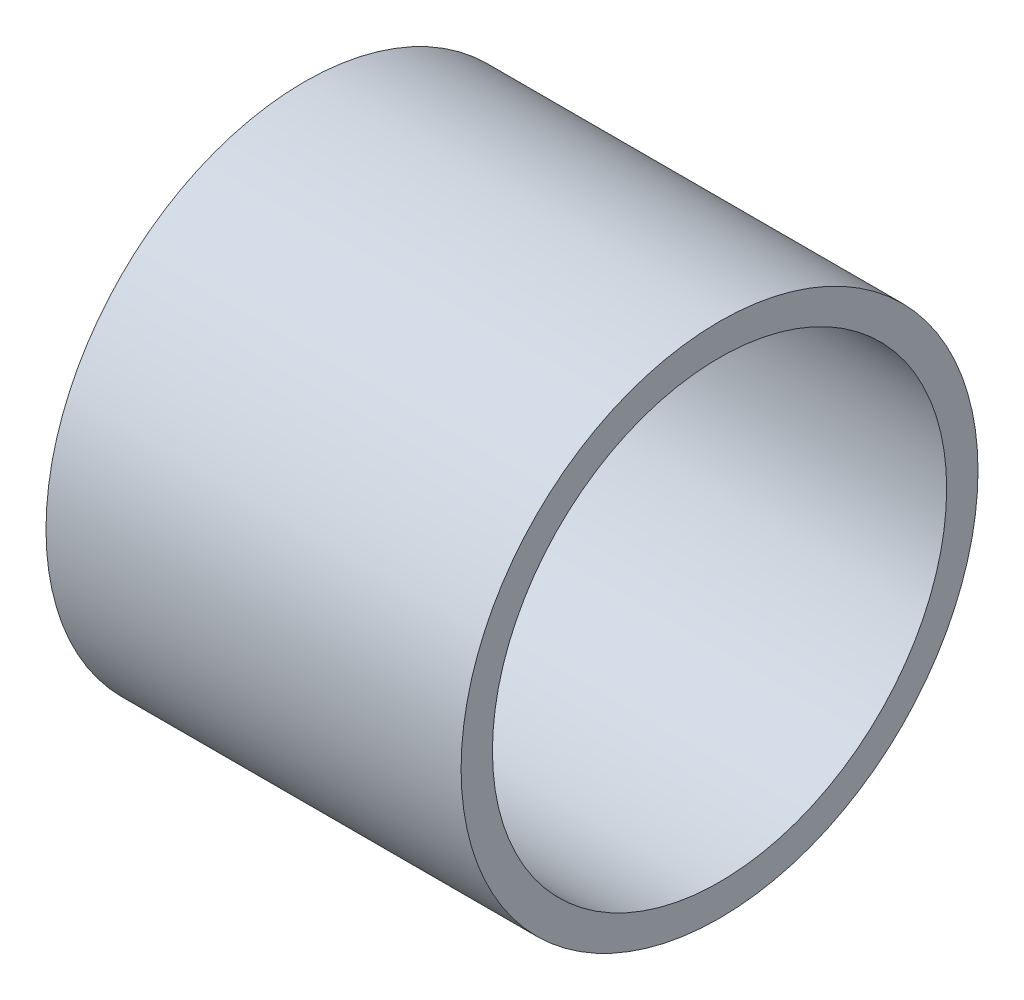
from build123d import *

# Parameters (mm, degrees)
ESQUISSE1_W = 53
ESQUISSE1_H = 4


with BuildPart() as part:
    # Esquisse1 → R_volution1 (revolve)
    with BuildSketch(Plane.XY, mode=Mode.PRIVATE) as r_volution1_sk:
        with Locations((26.5, 31)):
            Rectangle(ESQUISSE1_W, ESQUISSE1_H)
    revolve(r_volution1_sk.sketch.rotate(Axis((0, 0, 0), (1, 0, 0)), 90), axis=Axis((0, 0, 0), (1, 0, 0)))


solid = part.part
